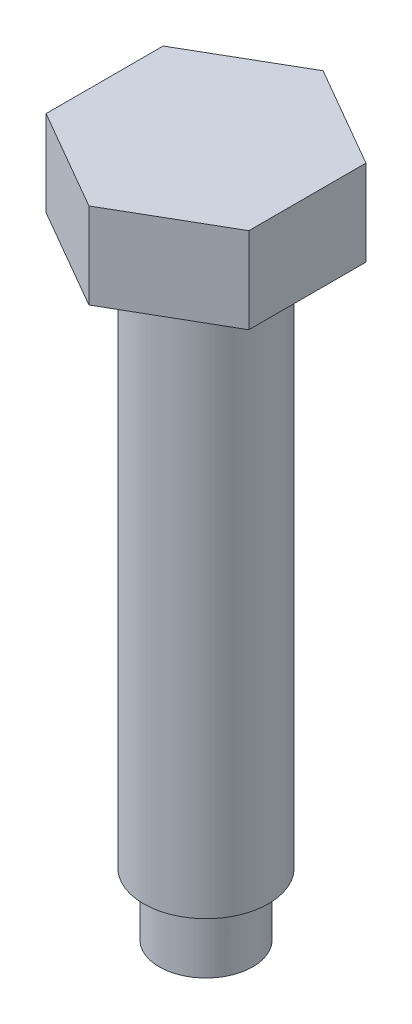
ISO-10303-21;
HEADER;
FILE_DESCRIPTION(('STEP AP214'),'2;1');
FILE_NAME('part.step','',(''),(''),'','','');
FILE_SCHEMA(('AUTOMOTIVE_DESIGN { 1 0 10303 214 1 1 1 1 }'));
ENDSEC;
DATA;
#1=APPLICATION_CONTEXT('core data for automotive mechanical design processes');
#2=APPLICATION_PROTOCOL_DEFINITION('international standard','automotive_design',2000,#1);
#3=PRODUCT_CONTEXT('',#1,'mechanical');
#4=PRODUCT('Part','Part','',(#3));
#5=PRODUCT_RELATED_PRODUCT_CATEGORY('part','',(#4));
#6=PRODUCT_DEFINITION_FORMATION('','',#4);
#7=PRODUCT_DEFINITION_CONTEXT('part definition',#1,'design');
#8=PRODUCT_DEFINITION('design','',#6,#7);
#9=PRODUCT_DEFINITION_SHAPE('','',#8);
#10=(LENGTH_UNIT() NAMED_UNIT(*) SI_UNIT(.MILLI.,.METRE.));
#11=(NAMED_UNIT(*) PLANE_ANGLE_UNIT() SI_UNIT($,.RADIAN.));
#12=(NAMED_UNIT(*) SI_UNIT($,.STERADIAN.) SOLID_ANGLE_UNIT());
#13=UNCERTAINTY_MEASURE_WITH_UNIT(LENGTH_MEASURE(1.E-05),#10,'distance_accuracy_value','');
#14=(GEOMETRIC_REPRESENTATION_CONTEXT(3) GLOBAL_UNCERTAINTY_ASSIGNED_CONTEXT((#13)) GLOBAL_UNIT_ASSIGNED_CONTEXT((#10,
#11,#12)) REPRESENTATION_CONTEXT('',''));
#15=CARTESIAN_POINT('',(0.,0.,0.));
#16=DIRECTION('',(0.,0.,1.));
#17=DIRECTION('',(1.,0.,0.));
#18=AXIS2_PLACEMENT_3D('',#15,#16,#17);
#19=CARTESIAN_POINT('',(-6.5,0.,-11.2583302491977));
#20=DIRECTION('',(0.,1.,0.));
#21=DIRECTION('',(0.,0.,1.));
#22=AXIS2_PLACEMENT_3D('',#19,#20,#21);
#23=PLANE('',#22);
#24=DIRECTION('',(-0.866025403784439,0.,-0.5));
#25=VECTOR('',#24,1.);
#26=CARTESIAN_POINT('',(6.5,0.,-3.75277674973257));
#27=LINE('',#26,#25);
#28=CARTESIAN_POINT('',(6.5,0.,-3.75277674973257));
#29=VERTEX_POINT('',#28);
#30=CARTESIAN_POINT('',(0.,0.,-7.50555349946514));
#31=VERTEX_POINT('',#30);
#32=EDGE_CURVE('E100',#29,#31,#27,.T.);
#33=ORIENTED_EDGE('',*,*,#32,.F.);
#34=DIRECTION('',(0.,0.,-1.));
#35=VECTOR('',#34,1.);
#36=CARTESIAN_POINT('',(6.5,0.,3.75277674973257));
#37=LINE('',#36,#35);
#38=CARTESIAN_POINT('',(6.5,0.,3.75277674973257));
#39=VERTEX_POINT('',#38);
#40=EDGE_CURVE('E60',#39,#29,#37,.T.);
#41=ORIENTED_EDGE('',*,*,#40,.F.);
#42=DIRECTION('',(0.866025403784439,0.,-0.5));
#43=VECTOR('',#42,1.);
#44=CARTESIAN_POINT('',(0.,0.,7.50555349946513));
#45=LINE('',#44,#43);
#46=CARTESIAN_POINT('',(0.,0.,7.50555349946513));
#47=VERTEX_POINT('',#46);
#48=EDGE_CURVE('E54',#47,#39,#45,.T.);
#49=ORIENTED_EDGE('',*,*,#48,.F.);
#50=DIRECTION('',(0.866025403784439,0.,0.5));
#51=VECTOR('',#50,1.);
#52=CARTESIAN_POINT('',(-6.5,0.,3.75277674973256));
#53=LINE('',#52,#51);
#54=CARTESIAN_POINT('',(-6.5,0.,3.75277674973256));
#55=VERTEX_POINT('',#54);
#56=EDGE_CURVE('E90',#55,#47,#53,.T.);
#57=ORIENTED_EDGE('',*,*,#56,.F.);
#58=DIRECTION('',(0.,0.,1.));
#59=VECTOR('',#58,1.);
#60=CARTESIAN_POINT('',(-6.5,0.,-3.75277674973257));
#61=LINE('',#60,#59);
#62=CARTESIAN_POINT('',(-6.5,0.,-3.75277674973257));
#63=VERTEX_POINT('',#62);
#64=EDGE_CURVE('E106',#63,#55,#61,.T.);
#65=ORIENTED_EDGE('',*,*,#64,.F.);
#66=DIRECTION('',(-0.866025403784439,0.,0.5));
#67=VECTOR('',#66,1.);
#68=CARTESIAN_POINT('',(0.,0.,-7.50555349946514));
#69=LINE('',#68,#67);
#70=EDGE_CURVE('E103',#31,#63,#69,.T.);
#71=ORIENTED_EDGE('',*,*,#70,.F.);
#72=EDGE_LOOP('',(#33,#41,#49,#57,#65,#71));
#73=FACE_BOUND('',#72,.T.);
#74=CARTESIAN_POINT('',(0.,0.,0.));
#75=DIRECTION('',(0.,1.,0.));
#76=DIRECTION('',(0.,0.,1.));
#77=AXIS2_PLACEMENT_3D('',#74,#75,#76);
#78=CIRCLE('',#77,4.);
#79=CARTESIAN_POINT('',(0.,0.,4.));
#80=VERTEX_POINT('',#79);
#81=EDGE_CURVE('E9',#80,#80,#78,.F.);
#82=ORIENTED_EDGE('',*,*,#81,.F.);
#83=EDGE_LOOP('',(#82));
#84=FACE_BOUND('',#83,.T.);
#85=ADVANCED_FACE('F14',(#73,#84),#23,.F.);
#86=CARTESIAN_POINT('',(6.5,5.5,-3.75277674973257));
#87=DIRECTION('',(-0.5,0.,0.866025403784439));
#88=DIRECTION('',(0.866025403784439,0.,0.5));
#89=AXIS2_PLACEMENT_3D('',#86,#87,#88);
#90=PLANE('',#89);
#91=ORIENTED_EDGE('',*,*,#32,.T.);
#92=DIRECTION('',(0.,-1.,0.));
#93=VECTOR('',#92,1.);
#94=CARTESIAN_POINT('',(0.,5.5,-7.50555349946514));
#95=LINE('',#94,#93);
#96=CARTESIAN_POINT('',(0.,5.5,-7.50555349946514));
#97=VERTEX_POINT('',#96);
#98=EDGE_CURVE('E23',#97,#31,#95,.T.);
#99=ORIENTED_EDGE('',*,*,#98,.F.);
#100=DIRECTION('',(-0.866025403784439,0.,-0.5));
#101=VECTOR('',#100,1.);
#102=CARTESIAN_POINT('',(6.5,5.5,-3.75277674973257));
#103=LINE('',#102,#101);
#104=CARTESIAN_POINT('',(6.5,5.5,-3.75277674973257));
#105=VERTEX_POINT('',#104);
#106=EDGE_CURVE('E111',#105,#97,#103,.T.);
#107=ORIENTED_EDGE('',*,*,#106,.F.);
#108=DIRECTION('',(0.,-1.,0.));
#109=VECTOR('',#108,1.);
#110=CARTESIAN_POINT('',(6.5,5.5,-3.75277674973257));
#111=LINE('',#110,#109);
#112=EDGE_CURVE('E96',#105,#29,#111,.T.);
#113=ORIENTED_EDGE('',*,*,#112,.T.);
#114=EDGE_LOOP('',(#91,#99,#107,#113));
#115=FACE_BOUND('',#114,.T.);
#116=ADVANCED_FACE('F16',(#115),#90,.F.);
#117=CARTESIAN_POINT('',(0.,5.5,-7.50555349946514));
#118=DIRECTION('',(0.5,0.,0.866025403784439));
#119=DIRECTION('',(0.866025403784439,0.,-0.5));
#120=AXIS2_PLACEMENT_3D('',#117,#118,#119);
#121=PLANE('',#120);
#122=ORIENTED_EDGE('',*,*,#70,.T.);
#123=DIRECTION('',(0.,-1.,0.));
#124=VECTOR('',#123,1.);
#125=CARTESIAN_POINT('',(-6.5,5.5,-3.75277674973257));
#126=LINE('',#125,#124);
#127=CARTESIAN_POINT('',(-6.5,5.5,-3.75277674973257));
#128=VERTEX_POINT('',#127);
#129=EDGE_CURVE('E115',#128,#63,#126,.T.);
#130=ORIENTED_EDGE('',*,*,#129,.F.);
#131=DIRECTION('',(-0.866025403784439,0.,0.5));
#132=VECTOR('',#131,1.);
#133=CARTESIAN_POINT('',(0.,5.5,-7.50555349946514));
#134=LINE('',#133,#132);
#135=EDGE_CURVE('E69',#97,#128,#134,.T.);
#136=ORIENTED_EDGE('',*,*,#135,.F.);
#137=ORIENTED_EDGE('',*,*,#98,.T.);
#138=EDGE_LOOP('',(#122,#130,#136,#137));
#139=FACE_BOUND('',#138,.T.);
#140=ADVANCED_FACE('F118',(#139),#121,.F.);
#141=CARTESIAN_POINT('',(-6.5,5.5,-3.75277674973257));
#142=DIRECTION('',(1.,0.,0.));
#143=DIRECTION('',(0.,0.,-1.));
#144=AXIS2_PLACEMENT_3D('',#141,#142,#143);
#145=PLANE('',#144);
#146=ORIENTED_EDGE('',*,*,#64,.T.);
#147=DIRECTION('',(0.,-1.,0.));
#148=VECTOR('',#147,1.);
#149=CARTESIAN_POINT('',(-6.5,5.5,3.75277674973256));
#150=LINE('',#149,#148);
#151=CARTESIAN_POINT('',(-6.5,5.5,3.75277674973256));
#152=VERTEX_POINT('',#151);
#153=EDGE_CURVE('E91',#152,#55,#150,.T.);
#154=ORIENTED_EDGE('',*,*,#153,.F.);
#155=DIRECTION('',(0.,0.,1.));
#156=VECTOR('',#155,1.);
#157=CARTESIAN_POINT('',(-6.5,5.5,-3.75277674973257));
#158=LINE('',#157,#156);
#159=EDGE_CURVE('E82',#128,#152,#158,.T.);
#160=ORIENTED_EDGE('',*,*,#159,.F.);
#161=ORIENTED_EDGE('',*,*,#129,.T.);
#162=EDGE_LOOP('',(#146,#154,#160,#161));
#163=FACE_BOUND('',#162,.T.);
#164=ADVANCED_FACE('F126',(#163),#145,.F.);
#165=CARTESIAN_POINT('',(-6.5,5.5,3.75277674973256));
#166=DIRECTION('',(0.5,0.,-0.866025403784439));
#167=DIRECTION('',(-0.866025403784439,0.,-0.5));
#168=AXIS2_PLACEMENT_3D('',#165,#166,#167);
#169=PLANE('',#168);
#170=ORIENTED_EDGE('',*,*,#56,.T.);
#171=DIRECTION('',(0.,-1.,0.));
#172=VECTOR('',#171,1.);
#173=CARTESIAN_POINT('',(0.,5.5,7.50555349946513));
#174=LINE('',#173,#172);
#175=CARTESIAN_POINT('',(0.,5.5,7.50555349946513));
#176=VERTEX_POINT('',#175);
#177=EDGE_CURVE('E87',#176,#47,#174,.T.);
#178=ORIENTED_EDGE('',*,*,#177,.F.);
#179=DIRECTION('',(0.866025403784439,0.,0.5));
#180=VECTOR('',#179,1.);
#181=CARTESIAN_POINT('',(-6.5,5.5,3.75277674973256));
#182=LINE('',#181,#180);
#183=EDGE_CURVE('E76',#152,#176,#182,.T.);
#184=ORIENTED_EDGE('',*,*,#183,.F.);
#185=ORIENTED_EDGE('',*,*,#153,.T.);
#186=EDGE_LOOP('',(#170,#178,#184,#185));
#187=FACE_BOUND('',#186,.T.);
#188=ADVANCED_FACE('F88',(#187),#169,.F.);
#189=CARTESIAN_POINT('',(0.,5.5,7.50555349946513));
#190=DIRECTION('',(-0.5,0.,-0.866025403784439));
#191=DIRECTION('',(-0.866025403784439,0.,0.5));
#192=AXIS2_PLACEMENT_3D('',#189,#190,#191);
#193=PLANE('',#192);
#194=ORIENTED_EDGE('',*,*,#48,.T.);
#195=DIRECTION('',(0.,-1.,0.));
#196=VECTOR('',#195,1.);
#197=CARTESIAN_POINT('',(6.5,5.5,3.75277674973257));
#198=LINE('',#197,#196);
#199=CARTESIAN_POINT('',(6.5,5.5,3.75277674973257));
#200=VERTEX_POINT('',#199);
#201=EDGE_CURVE('E92',#200,#39,#198,.T.);
#202=ORIENTED_EDGE('',*,*,#201,.F.);
#203=DIRECTION('',(0.866025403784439,0.,-0.5));
#204=VECTOR('',#203,1.);
#205=CARTESIAN_POINT('',(0.,5.5,7.50555349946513));
#206=LINE('',#205,#204);
#207=EDGE_CURVE('E80',#176,#200,#206,.T.);
#208=ORIENTED_EDGE('',*,*,#207,.F.);
#209=ORIENTED_EDGE('',*,*,#177,.T.);
#210=EDGE_LOOP('',(#194,#202,#208,#209));
#211=FACE_BOUND('',#210,.T.);
#212=ADVANCED_FACE('F94',(#211),#193,.F.);
#213=CARTESIAN_POINT('',(6.5,5.5,3.75277674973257));
#214=DIRECTION('',(-1.,0.,0.));
#215=DIRECTION('',(0.,0.,1.));
#216=AXIS2_PLACEMENT_3D('',#213,#214,#215);
#217=PLANE('',#216);
#218=ORIENTED_EDGE('',*,*,#40,.T.);
#219=ORIENTED_EDGE('',*,*,#112,.F.);
#220=DIRECTION('',(0.,0.,-1.));
#221=VECTOR('',#220,1.);
#222=CARTESIAN_POINT('',(6.5,5.5,3.75277674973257));
#223=LINE('',#222,#221);
#224=EDGE_CURVE('E31',#200,#105,#223,.T.);
#225=ORIENTED_EDGE('',*,*,#224,.F.);
#226=ORIENTED_EDGE('',*,*,#201,.T.);
#227=EDGE_LOOP('',(#218,#219,#225,#226));
#228=FACE_BOUND('',#227,.T.);
#229=ADVANCED_FACE('F161',(#228),#217,.F.);
#230=CARTESIAN_POINT('',(-6.5,5.5,-11.2583302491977));
#231=DIRECTION('',(0.,1.,0.));
#232=DIRECTION('',(0.,0.,1.));
#233=AXIS2_PLACEMENT_3D('',#230,#231,#232);
#234=PLANE('',#233);
#235=ORIENTED_EDGE('',*,*,#106,.T.);
#236=ORIENTED_EDGE('',*,*,#135,.T.);
#237=ORIENTED_EDGE('',*,*,#159,.T.);
#238=ORIENTED_EDGE('',*,*,#183,.T.);
#239=ORIENTED_EDGE('',*,*,#207,.T.);
#240=ORIENTED_EDGE('',*,*,#224,.T.);
#241=EDGE_LOOP('',(#235,#236,#237,#238,#239,#240));
#242=FACE_BOUND('',#241,.T.);
#243=ADVANCED_FACE('F78',(#242),#234,.T.);
#244=CARTESIAN_POINT('',(0.,0.,0.));
#245=DIRECTION('',(0.,1.,0.));
#246=DIRECTION('',(0.,0.,1.));
#247=AXIS2_PLACEMENT_3D('',#244,#245,#246);
#248=CYLINDRICAL_SURFACE('',#247,4.);
#249=ORIENTED_EDGE('',*,*,#81,.T.);
#250=EDGE_LOOP('',(#249));
#251=FACE_BOUND('',#250,.T.);
#252=CARTESIAN_POINT('',(0.,-35.,0.));
#253=DIRECTION('',(0.,1.,0.));
#254=DIRECTION('',(0.,0.,1.));
#255=AXIS2_PLACEMENT_3D('',#252,#253,#254);
#256=CIRCLE('',#255,4.);
#257=CARTESIAN_POINT('',(0.,-35.,4.));
#258=VERTEX_POINT('',#257);
#259=EDGE_CURVE('E104',#258,#258,#256,.T.);
#260=ORIENTED_EDGE('',*,*,#259,.T.);
#261=EDGE_LOOP('',(#260));
#262=FACE_BOUND('',#261,.T.);
#263=ADVANCED_FACE('F206',(#251,#262),#248,.T.);
#264=CARTESIAN_POINT('',(0.,-35.5773502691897,0.));
#265=DIRECTION('',(0.,1.,0.));
#266=DIRECTION('',(0.,0.,1.));
#267=AXIS2_PLACEMENT_3D('',#264,#265,#266);
#268=CONICAL_SURFACE('',#267,3.,1.0471975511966);
#269=ORIENTED_EDGE('',*,*,#259,.F.);
#270=EDGE_LOOP('',(#269));
#271=FACE_BOUND('',#270,.T.);
#272=CARTESIAN_POINT('',(0.,-35.5773502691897,0.));
#273=DIRECTION('',(0.,1.,0.));
#274=DIRECTION('',(0.,0.,1.));
#275=AXIS2_PLACEMENT_3D('',#272,#273,#274);
#276=CIRCLE('',#275,3.);
#277=CARTESIAN_POINT('',(0.,-35.5773502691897,3.));
#278=VERTEX_POINT('',#277);
#279=EDGE_CURVE('E132',#278,#278,#276,.T.);
#280=ORIENTED_EDGE('',*,*,#279,.T.);
#281=EDGE_LOOP('',(#280));
#282=FACE_BOUND('',#281,.T.);
#283=ADVANCED_FACE('F149',(#271,#282),#268,.T.);
#284=CARTESIAN_POINT('',(0.,0.,0.));
#285=DIRECTION('',(0.,1.,0.));
#286=DIRECTION('',(0.,0.,1.));
#287=AXIS2_PLACEMENT_3D('',#284,#285,#286);
#288=CYLINDRICAL_SURFACE('',#287,3.);
#289=ORIENTED_EDGE('',*,*,#279,.F.);
#290=EDGE_LOOP('',(#289));
#291=FACE_BOUND('',#290,.T.);
#292=CARTESIAN_POINT('',(0.,-39.,0.));
#293=DIRECTION('',(0.,1.,0.));
#294=DIRECTION('',(0.,0.,1.));
#295=AXIS2_PLACEMENT_3D('',#292,#293,#294);
#296=CIRCLE('',#295,3.);
#297=CARTESIAN_POINT('',(0.,-39.,3.));
#298=VERTEX_POINT('',#297);
#299=EDGE_CURVE('E135',#298,#298,#296,.T.);
#300=ORIENTED_EDGE('',*,*,#299,.T.);
#301=EDGE_LOOP('',(#300));
#302=FACE_BOUND('',#301,.T.);
#303=ADVANCED_FACE('F139',(#291,#302),#288,.T.);
#304=CARTESIAN_POINT('',(0.,-35.,0.));
#305=DIRECTION('',(0.,1.,0.));
#306=DIRECTION('',(1.,0.,0.));
#307=AXIS2_PLACEMENT_3D('',#304,#305,#306);
#308=SPHERICAL_SURFACE('',#307,5.);
#309=ORIENTED_EDGE('',*,*,#299,.F.);
#310=EDGE_LOOP('',(#309));
#311=FACE_BOUND('',#310,.T.);
#312=ADVANCED_FACE('F141',(#311),#308,.T.);
#313=CLOSED_SHELL('',(#85,#116,#140,#164,#188,#212,#229,#243,#263,#283,#303,#312));
#314=MANIFOLD_SOLID_BREP('B1',#313);
#315=ADVANCED_BREP_SHAPE_REPRESENTATION('',(#18,#314),#14);
#316=SHAPE_DEFINITION_REPRESENTATION(#9,#315);
ENDSEC;
END-ISO-10303-21;
